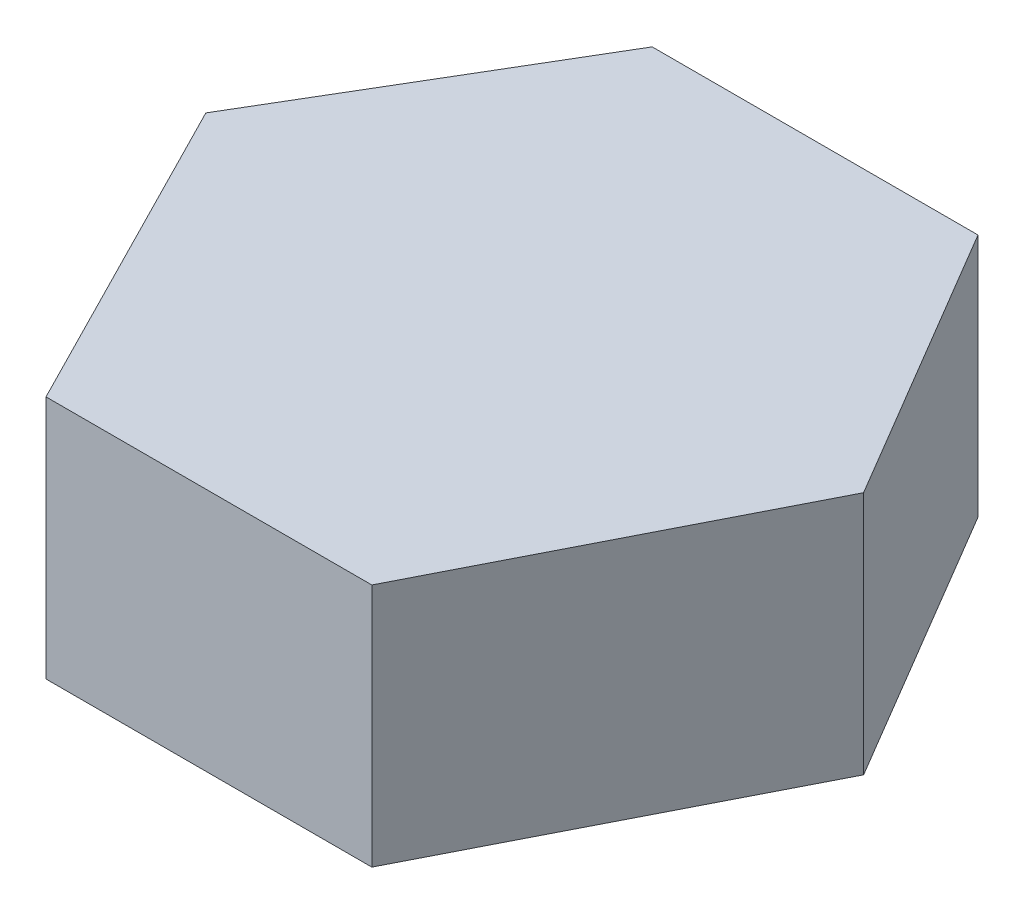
ISO-10303-21;
HEADER;
FILE_DESCRIPTION(('STEP AP214'),'2;1');
FILE_NAME('part.step','',(''),(''),'','','');
FILE_SCHEMA(('AUTOMOTIVE_DESIGN { 1 0 10303 214 1 1 1 1 }'));
ENDSEC;
DATA;
#1=APPLICATION_CONTEXT('core data for automotive mechanical design processes');
#2=APPLICATION_PROTOCOL_DEFINITION('international standard','automotive_design',2000,#1);
#3=PRODUCT_CONTEXT('',#1,'mechanical');
#4=PRODUCT('Part','Part','',(#3));
#5=PRODUCT_RELATED_PRODUCT_CATEGORY('part','',(#4));
#6=PRODUCT_DEFINITION_FORMATION('','',#4);
#7=PRODUCT_DEFINITION_CONTEXT('part definition',#1,'design');
#8=PRODUCT_DEFINITION('design','',#6,#7);
#9=PRODUCT_DEFINITION_SHAPE('','',#8);
#10=(LENGTH_UNIT() NAMED_UNIT(*) SI_UNIT(.MILLI.,.METRE.));
#11=(NAMED_UNIT(*) PLANE_ANGLE_UNIT() SI_UNIT($,.RADIAN.));
#12=(NAMED_UNIT(*) SI_UNIT($,.STERADIAN.) SOLID_ANGLE_UNIT());
#13=UNCERTAINTY_MEASURE_WITH_UNIT(LENGTH_MEASURE(1.E-05),#10,'distance_accuracy_value','');
#14=(GEOMETRIC_REPRESENTATION_CONTEXT(3) GLOBAL_UNCERTAINTY_ASSIGNED_CONTEXT((#13)) GLOBAL_UNIT_ASSIGNED_CONTEXT((#10,
#11,#12)) REPRESENTATION_CONTEXT('',''));
#15=CARTESIAN_POINT('',(0.,0.,0.));
#16=DIRECTION('',(0.,0.,1.));
#17=DIRECTION('',(1.,0.,0.));
#18=AXIS2_PLACEMENT_3D('',#15,#16,#17);
#19=CARTESIAN_POINT('',(-37.3332966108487,30.,-34.4206038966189));
#20=DIRECTION('',(0.860515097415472,0.,0.509424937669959));
#21=DIRECTION('',(0.509424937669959,0.,-0.860515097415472));
#22=AXIS2_PLACEMENT_3D('',#19,#20,#21);
#23=PLANE('',#22);
#24=DIRECTION('',(-0.509424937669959,0.,0.860515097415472));
#25=VECTOR('',#24,1.);
#26=CARTESIAN_POINT('',(-37.3332966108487,0.,-34.4206038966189));
#27=LINE('',#26,#25);
#28=CARTESIAN_POINT('',(-37.3332966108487,0.,-34.4206038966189));
#29=VERTEX_POINT('',#28);
#30=CARTESIAN_POINT('',(-57.7102941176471,0.,0.));
#31=VERTEX_POINT('',#30);
#32=EDGE_CURVE('E115',#29,#31,#27,.T.);
#33=ORIENTED_EDGE('',*,*,#32,.T.);
#34=DIRECTION('',(0.,-1.,0.));
#35=VECTOR('',#34,1.);
#36=CARTESIAN_POINT('',(-57.7102941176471,30.,0.));
#37=LINE('',#36,#35);
#38=CARTESIAN_POINT('',(-57.7102941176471,30.,0.));
#39=VERTEX_POINT('',#38);
#40=EDGE_CURVE('E11',#39,#31,#37,.T.);
#41=ORIENTED_EDGE('',*,*,#40,.F.);
#42=DIRECTION('',(-0.509424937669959,0.,0.860515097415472));
#43=VECTOR('',#42,1.);
#44=CARTESIAN_POINT('',(-37.3332966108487,30.,-34.4206038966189));
#45=LINE('',#44,#43);
#46=CARTESIAN_POINT('',(-37.3332966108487,30.,-34.4206038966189));
#47=VERTEX_POINT('',#46);
#48=EDGE_CURVE('E125',#47,#39,#45,.T.);
#49=ORIENTED_EDGE('',*,*,#48,.F.);
#50=DIRECTION('',(0.,-1.,0.));
#51=VECTOR('',#50,1.);
#52=CARTESIAN_POINT('',(-37.3332966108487,30.,-34.4206038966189));
#53=LINE('',#52,#51);
#54=EDGE_CURVE('E111',#47,#29,#53,.T.);
#55=ORIENTED_EDGE('',*,*,#54,.T.);
#56=EDGE_LOOP('',(#33,#41,#49,#55));
#57=FACE_BOUND('',#56,.T.);
#58=ADVANCED_FACE('F31',(#57),#23,.F.);
#59=CARTESIAN_POINT('',(-57.7102941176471,30.,0.));
#60=DIRECTION('',(0.891042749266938,0.,-0.453919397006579));
#61=DIRECTION('',(-0.453919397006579,0.,-0.891042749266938));
#62=AXIS2_PLACEMENT_3D('',#59,#60,#61);
#63=PLANE('',#62);
#64=DIRECTION('',(0.453919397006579,0.,0.891042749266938));
#65=VECTOR('',#64,1.);
#66=CARTESIAN_POINT('',(-57.7102941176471,0.,0.));
#67=LINE('',#66,#65);
#68=CARTESIAN_POINT('',(-37.3332966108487,0.,40.));
#69=VERTEX_POINT('',#68);
#70=EDGE_CURVE('E118',#31,#69,#67,.T.);
#71=ORIENTED_EDGE('',*,*,#70,.T.);
#72=DIRECTION('',(0.,-1.,0.));
#73=VECTOR('',#72,1.);
#74=CARTESIAN_POINT('',(-37.3332966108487,30.,40.));
#75=LINE('',#74,#73);
#76=CARTESIAN_POINT('',(-37.3332966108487,30.,40.));
#77=VERTEX_POINT('',#76);
#78=EDGE_CURVE('E39',#77,#69,#75,.T.);
#79=ORIENTED_EDGE('',*,*,#78,.F.);
#80=DIRECTION('',(0.453919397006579,0.,0.891042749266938));
#81=VECTOR('',#80,1.);
#82=CARTESIAN_POINT('',(-57.7102941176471,30.,0.));
#83=LINE('',#82,#81);
#84=EDGE_CURVE('E84',#39,#77,#83,.T.);
#85=ORIENTED_EDGE('',*,*,#84,.F.);
#86=ORIENTED_EDGE('',*,*,#40,.T.);
#87=EDGE_LOOP('',(#71,#79,#85,#86));
#88=FACE_BOUND('',#87,.T.);
#89=ADVANCED_FACE('F149',(#88),#63,.F.);
#90=CARTESIAN_POINT('',(-37.3332966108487,30.,40.));
#91=DIRECTION('',(0.,0.,-1.));
#92=DIRECTION('',(-1.,0.,0.));
#93=AXIS2_PLACEMENT_3D('',#90,#91,#92);
#94=PLANE('',#93);
#95=DIRECTION('',(1.,0.,0.));
#96=VECTOR('',#95,1.);
#97=CARTESIAN_POINT('',(-37.3332966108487,0.,40.));
#98=LINE('',#97,#96);
#99=CARTESIAN_POINT('',(2.66670338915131,0.,40.));
#100=VERTEX_POINT('',#99);
#101=EDGE_CURVE('E120',#69,#100,#98,.T.);
#102=ORIENTED_EDGE('',*,*,#101,.T.);
#103=DIRECTION('',(0.,-1.,0.));
#104=VECTOR('',#103,1.);
#105=CARTESIAN_POINT('',(2.66670338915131,30.,40.));
#106=LINE('',#105,#104);
#107=CARTESIAN_POINT('',(2.66670338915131,30.,40.));
#108=VERTEX_POINT('',#107);
#109=EDGE_CURVE('E106',#108,#100,#106,.T.);
#110=ORIENTED_EDGE('',*,*,#109,.F.);
#111=DIRECTION('',(1.,0.,0.));
#112=VECTOR('',#111,1.);
#113=CARTESIAN_POINT('',(-37.3332966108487,30.,40.));
#114=LINE('',#113,#112);
#115=EDGE_CURVE('E97',#77,#108,#114,.T.);
#116=ORIENTED_EDGE('',*,*,#115,.F.);
#117=ORIENTED_EDGE('',*,*,#78,.T.);
#118=EDGE_LOOP('',(#102,#110,#116,#117));
#119=FACE_BOUND('',#118,.T.);
#120=ADVANCED_FACE('F131',(#119),#94,.F.);
#121=CARTESIAN_POINT('',(23.0437008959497,30.,0.));
#122=DIRECTION('',(-0.891042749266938,0.,-0.453919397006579));
#123=DIRECTION('',(-0.453919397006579,0.,0.891042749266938));
#124=AXIS2_PLACEMENT_3D('',#121,#122,#123);
#125=PLANE('',#124);
#126=DIRECTION('',(0.453919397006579,0.,-0.891042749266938));
#127=VECTOR('',#126,1.);
#128=CARTESIAN_POINT('',(23.0437008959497,0.,0.));
#129=LINE('',#128,#127);
#130=CARTESIAN_POINT('',(23.0437008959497,0.,0.));
#131=VERTEX_POINT('',#130);
#132=EDGE_CURVE('E105',#100,#131,#129,.T.);
#133=ORIENTED_EDGE('',*,*,#132,.T.);
#134=DIRECTION('',(0.,-1.,0.));
#135=VECTOR('',#134,1.);
#136=CARTESIAN_POINT('',(23.0437008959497,30.,0.));
#137=LINE('',#136,#135);
#138=CARTESIAN_POINT('',(23.0437008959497,30.,0.));
#139=VERTEX_POINT('',#138);
#140=EDGE_CURVE('E102',#139,#131,#137,.T.);
#141=ORIENTED_EDGE('',*,*,#140,.F.);
#142=DIRECTION('',(0.453919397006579,0.,-0.891042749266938));
#143=VECTOR('',#142,1.);
#144=CARTESIAN_POINT('',(23.0437008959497,30.,0.));
#145=LINE('',#144,#143);
#146=EDGE_CURVE('E91',#108,#139,#145,.T.);
#147=ORIENTED_EDGE('',*,*,#146,.F.);
#148=ORIENTED_EDGE('',*,*,#109,.T.);
#149=EDGE_LOOP('',(#133,#141,#147,#148));
#150=FACE_BOUND('',#149,.T.);
#151=ADVANCED_FACE('F103',(#150),#125,.F.);
#152=CARTESIAN_POINT('',(2.6667033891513,30.,-34.4206038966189));
#153=DIRECTION('',(-0.860515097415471,0.,0.509424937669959));
#154=DIRECTION('',(0.509424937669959,0.,0.860515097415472));
#155=AXIS2_PLACEMENT_3D('',#152,#153,#154);
#156=PLANE('',#155);
#157=DIRECTION('',(-0.509424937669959,0.,-0.860515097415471));
#158=VECTOR('',#157,1.);
#159=CARTESIAN_POINT('',(2.6667033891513,0.,-34.4206038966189));
#160=LINE('',#159,#158);
#161=CARTESIAN_POINT('',(2.6667033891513,0.,-34.4206038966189));
#162=VERTEX_POINT('',#161);
#163=EDGE_CURVE('E70',#131,#162,#160,.T.);
#164=ORIENTED_EDGE('',*,*,#163,.T.);
#165=DIRECTION('',(0.,-1.,0.));
#166=VECTOR('',#165,1.);
#167=CARTESIAN_POINT('',(2.6667033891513,30.,-34.4206038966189));
#168=LINE('',#167,#166);
#169=CARTESIAN_POINT('',(2.6667033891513,30.,-34.4206038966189));
#170=VERTEX_POINT('',#169);
#171=EDGE_CURVE('E107',#170,#162,#168,.T.);
#172=ORIENTED_EDGE('',*,*,#171,.F.);
#173=DIRECTION('',(-0.509424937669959,0.,-0.860515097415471));
#174=VECTOR('',#173,1.);
#175=CARTESIAN_POINT('',(2.6667033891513,30.,-34.4206038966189));
#176=LINE('',#175,#174);
#177=EDGE_CURVE('E95',#139,#170,#176,.T.);
#178=ORIENTED_EDGE('',*,*,#177,.F.);
#179=ORIENTED_EDGE('',*,*,#140,.T.);
#180=EDGE_LOOP('',(#164,#172,#178,#179));
#181=FACE_BOUND('',#180,.T.);
#182=ADVANCED_FACE('F109',(#181),#156,.F.);
#183=CARTESIAN_POINT('',(2.6667033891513,30.,-34.4206038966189));
#184=DIRECTION('',(0.,0.,1.));
#185=DIRECTION('',(1.,0.,0.));
#186=AXIS2_PLACEMENT_3D('',#183,#184,#185);
#187=PLANE('',#186);
#188=DIRECTION('',(-1.,0.,0.));
#189=VECTOR('',#188,1.);
#190=CARTESIAN_POINT('',(2.6667033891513,0.,-34.4206038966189));
#191=LINE('',#190,#189);
#192=EDGE_CURVE('E76',#162,#29,#191,.T.);
#193=ORIENTED_EDGE('',*,*,#192,.T.);
#194=ORIENTED_EDGE('',*,*,#54,.F.);
#195=DIRECTION('',(-1.,0.,0.));
#196=VECTOR('',#195,1.);
#197=CARTESIAN_POINT('',(2.6667033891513,30.,-34.4206038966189));
#198=LINE('',#197,#196);
#199=EDGE_CURVE('E47',#170,#47,#198,.T.);
#200=ORIENTED_EDGE('',*,*,#199,.F.);
#201=ORIENTED_EDGE('',*,*,#171,.T.);
#202=EDGE_LOOP('',(#193,#194,#200,#201));
#203=FACE_BOUND('',#202,.T.);
#204=ADVANCED_FACE('F138',(#203),#187,.F.);
#205=CARTESIAN_POINT('',(-17.3332966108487,30.,-68.2043876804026));
#206=DIRECTION('',(0.,1.,0.));
#207=DIRECTION('',(0.,0.,1.));
#208=AXIS2_PLACEMENT_3D('',#205,#206,#207);
#209=PLANE('',#208);
#210=ORIENTED_EDGE('',*,*,#48,.T.);
#211=ORIENTED_EDGE('',*,*,#84,.T.);
#212=ORIENTED_EDGE('',*,*,#115,.T.);
#213=ORIENTED_EDGE('',*,*,#146,.T.);
#214=ORIENTED_EDGE('',*,*,#177,.T.);
#215=ORIENTED_EDGE('',*,*,#199,.T.);
#216=EDGE_LOOP('',(#210,#211,#212,#213,#214,#215));
#217=FACE_BOUND('',#216,.T.);
#218=ADVANCED_FACE('F93',(#217),#209,.T.);
#219=CARTESIAN_POINT('',(-17.3332966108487,0.,-68.2043876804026));
#220=DIRECTION('',(0.,1.,0.));
#221=DIRECTION('',(0.,0.,1.));
#222=AXIS2_PLACEMENT_3D('',#219,#220,#221);
#223=PLANE('',#222);
#224=ORIENTED_EDGE('',*,*,#32,.F.);
#225=ORIENTED_EDGE('',*,*,#192,.F.);
#226=ORIENTED_EDGE('',*,*,#163,.F.);
#227=ORIENTED_EDGE('',*,*,#132,.F.);
#228=ORIENTED_EDGE('',*,*,#101,.F.);
#229=ORIENTED_EDGE('',*,*,#70,.F.);
#230=EDGE_LOOP('',(#224,#225,#226,#227,#228,#229));
#231=FACE_BOUND('',#230,.T.);
#232=ADVANCED_FACE('F134',(#231),#223,.F.);
#233=CLOSED_SHELL('',(#58,#89,#120,#151,#182,#204,#218,#232));
#234=MANIFOLD_SOLID_BREP('B2',#233);
#235=ADVANCED_BREP_SHAPE_REPRESENTATION('',(#18,#234),#14);
#236=SHAPE_DEFINITION_REPRESENTATION(#9,#235);
ENDSEC;
END-ISO-10303-21;
